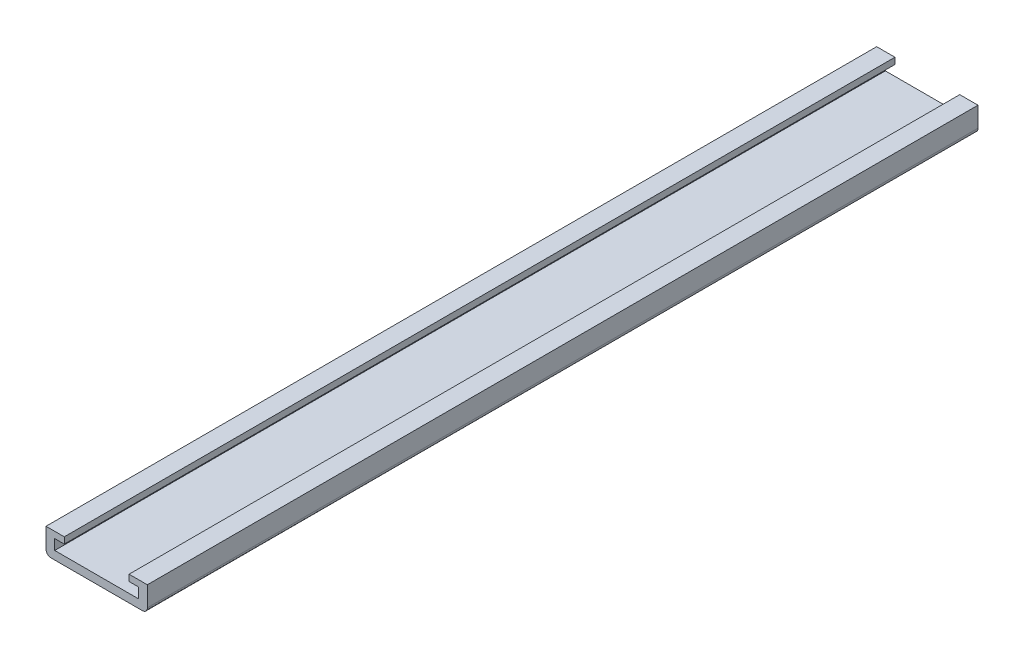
ISO-10303-21;
HEADER;
FILE_DESCRIPTION(('STEP AP214'),'2;1');
FILE_NAME('part.step','',(''),(''),'','','');
FILE_SCHEMA(('AUTOMOTIVE_DESIGN { 1 0 10303 214 1 1 1 1 }'));
ENDSEC;
DATA;
#1=APPLICATION_CONTEXT('core data for automotive mechanical design processes');
#2=APPLICATION_PROTOCOL_DEFINITION('international standard','automotive_design',2000,#1);
#3=PRODUCT_CONTEXT('',#1,'mechanical');
#4=PRODUCT('Part','Part','',(#3));
#5=PRODUCT_RELATED_PRODUCT_CATEGORY('part','',(#4));
#6=PRODUCT_DEFINITION_FORMATION('','',#4);
#7=PRODUCT_DEFINITION_CONTEXT('part definition',#1,'design');
#8=PRODUCT_DEFINITION('design','',#6,#7);
#9=PRODUCT_DEFINITION_SHAPE('','',#8);
#10=(LENGTH_UNIT() NAMED_UNIT(*) SI_UNIT(.MILLI.,.METRE.));
#11=(NAMED_UNIT(*) PLANE_ANGLE_UNIT() SI_UNIT($,.RADIAN.));
#12=(NAMED_UNIT(*) SI_UNIT($,.STERADIAN.) SOLID_ANGLE_UNIT());
#13=UNCERTAINTY_MEASURE_WITH_UNIT(LENGTH_MEASURE(1.E-05),#10,'distance_accuracy_value','');
#14=(GEOMETRIC_REPRESENTATION_CONTEXT(3) GLOBAL_UNCERTAINTY_ASSIGNED_CONTEXT((#13)) GLOBAL_UNIT_ASSIGNED_CONTEXT((#10,
#11,#12)) REPRESENTATION_CONTEXT('',''));
#15=CARTESIAN_POINT('',(0.,0.,0.));
#16=DIRECTION('',(0.,0.,1.));
#17=DIRECTION('',(1.,0.,0.));
#18=AXIS2_PLACEMENT_3D('',#15,#16,#17);
#19=CARTESIAN_POINT('',(27.5,2.9999999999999,500.));
#20=DIRECTION('',(0.,0.,-1.));
#21=DIRECTION('',(-1.,0.,0.));
#22=AXIS2_PLACEMENT_3D('',#19,#20,#21);
#23=CYLINDRICAL_SURFACE('',#22,3.);
#24=CARTESIAN_POINT('',(27.5,2.9999999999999,0.));
#25=DIRECTION('',(0.,0.,1.));
#26=DIRECTION('',(1.,0.,0.));
#27=AXIS2_PLACEMENT_3D('',#24,#25,#26);
#28=CIRCLE('',#27,3.);
#29=CARTESIAN_POINT('',(27.5,0.,0.));
#30=VERTEX_POINT('',#29);
#31=CARTESIAN_POINT('',(30.5,2.9999999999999,0.));
#32=VERTEX_POINT('',#31);
#33=EDGE_CURVE('E158',#30,#32,#28,.T.);
#34=ORIENTED_EDGE('',*,*,#33,.T.);
#35=DIRECTION('',(0.,0.,-1.));
#36=VECTOR('',#35,1.);
#37=CARTESIAN_POINT('',(30.5,2.9999999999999,500.));
#38=LINE('',#37,#36);
#39=CARTESIAN_POINT('',(30.5,2.9999999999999,500.));
#40=VERTEX_POINT('',#39);
#41=EDGE_CURVE('E9',#40,#32,#38,.T.);
#42=ORIENTED_EDGE('',*,*,#41,.F.);
#43=CARTESIAN_POINT('',(27.5,2.9999999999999,500.));
#44=DIRECTION('',(0.,0.,1.));
#45=DIRECTION('',(1.,0.,0.));
#46=AXIS2_PLACEMENT_3D('',#43,#44,#45);
#47=CIRCLE('',#46,3.);
#48=CARTESIAN_POINT('',(27.5,0.,500.));
#49=VERTEX_POINT('',#48);
#50=EDGE_CURVE('E181',#49,#40,#47,.T.);
#51=ORIENTED_EDGE('',*,*,#50,.F.);
#52=DIRECTION('',(0.,0.,-1.));
#53=VECTOR('',#52,1.);
#54=CARTESIAN_POINT('',(27.5,0.,500.));
#55=LINE('',#54,#53);
#56=EDGE_CURVE('E200',#49,#30,#55,.T.);
#57=ORIENTED_EDGE('',*,*,#56,.T.);
#58=EDGE_LOOP('',(#34,#42,#51,#57));
#59=FACE_BOUND('',#58,.T.);
#60=ADVANCED_FACE('F14',(#59),#23,.T.);
#61=CARTESIAN_POINT('',(30.5,2.9999999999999,500.));
#62=DIRECTION('',(-1.,0.,0.));
#63=DIRECTION('',(0.,-1.,0.));
#64=AXIS2_PLACEMENT_3D('',#61,#62,#63);
#65=PLANE('',#64);
#66=DIRECTION('',(0.,1.,0.));
#67=VECTOR('',#66,1.);
#68=CARTESIAN_POINT('',(30.5,2.9999999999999,0.));
#69=LINE('',#68,#67);
#70=CARTESIAN_POINT('',(30.5,15.,0.));
#71=VERTEX_POINT('',#70);
#72=EDGE_CURVE('E162',#32,#71,#69,.T.);
#73=ORIENTED_EDGE('',*,*,#72,.T.);
#74=DIRECTION('',(0.,0.,-1.));
#75=VECTOR('',#74,1.);
#76=CARTESIAN_POINT('',(30.5,15.,500.));
#77=LINE('',#76,#75);
#78=CARTESIAN_POINT('',(30.5,15.,500.));
#79=VERTEX_POINT('',#78);
#80=EDGE_CURVE('E21',#79,#71,#77,.T.);
#81=ORIENTED_EDGE('',*,*,#80,.F.);
#82=DIRECTION('',(0.,1.,0.));
#83=VECTOR('',#82,1.);
#84=CARTESIAN_POINT('',(30.5,2.9999999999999,500.));
#85=LINE('',#84,#83);
#86=EDGE_CURVE('E184',#40,#79,#85,.T.);
#87=ORIENTED_EDGE('',*,*,#86,.F.);
#88=ORIENTED_EDGE('',*,*,#41,.T.);
#89=EDGE_LOOP('',(#73,#81,#87,#88));
#90=FACE_BOUND('',#89,.T.);
#91=ADVANCED_FACE('F248',(#90),#65,.F.);
#92=CARTESIAN_POINT('',(30.5,15.,500.));
#93=DIRECTION('',(0.,-1.,0.));
#94=DIRECTION('',(1.,0.,0.));
#95=AXIS2_PLACEMENT_3D('',#92,#93,#94);
#96=PLANE('',#95);
#97=DIRECTION('',(-1.,0.,0.));
#98=VECTOR('',#97,1.);
#99=CARTESIAN_POINT('',(30.5,15.,0.));
#100=LINE('',#99,#98);
#101=CARTESIAN_POINT('',(19.5,15.,0.));
#102=VERTEX_POINT('',#101);
#103=EDGE_CURVE('E164',#71,#102,#100,.T.);
#104=ORIENTED_EDGE('',*,*,#103,.T.);
#105=DIRECTION('',(0.,0.,-1.));
#106=VECTOR('',#105,1.);
#107=CARTESIAN_POINT('',(19.5,15.,500.));
#108=LINE('',#107,#106);
#109=CARTESIAN_POINT('',(19.5,15.,500.));
#110=VERTEX_POINT('',#109);
#111=EDGE_CURVE('E215',#110,#102,#108,.T.);
#112=ORIENTED_EDGE('',*,*,#111,.F.);
#113=DIRECTION('',(-1.,0.,0.));
#114=VECTOR('',#113,1.);
#115=CARTESIAN_POINT('',(30.5,15.,500.));
#116=LINE('',#115,#114);
#117=EDGE_CURVE('E186',#79,#110,#116,.T.);
#118=ORIENTED_EDGE('',*,*,#117,.F.);
#119=ORIENTED_EDGE('',*,*,#80,.T.);
#120=EDGE_LOOP('',(#104,#112,#118,#119));
#121=FACE_BOUND('',#120,.T.);
#122=ADVANCED_FACE('F222',(#121),#96,.F.);
#123=CARTESIAN_POINT('',(19.5,12.2,500.));
#124=DIRECTION('',(1.,0.,0.));
#125=DIRECTION('',(0.,1.,0.));
#126=AXIS2_PLACEMENT_3D('',#123,#124,#125);
#127=PLANE('',#126);
#128=DIRECTION('',(0.,-1.,0.));
#129=VECTOR('',#128,1.);
#130=CARTESIAN_POINT('',(19.5,12.2,0.));
#131=LINE('',#130,#129);
#132=CARTESIAN_POINT('',(19.5,11.2,0.));
#133=VERTEX_POINT('',#132);
#134=EDGE_CURVE('E166',#102,#133,#131,.T.);
#135=ORIENTED_EDGE('',*,*,#134,.T.);
#136=DIRECTION('',(0.,0.,-1.));
#137=VECTOR('',#136,1.);
#138=CARTESIAN_POINT('',(19.5,11.2,505.836308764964));
#139=LINE('',#138,#137);
#140=CARTESIAN_POINT('',(19.5,11.2,500.));
#141=VERTEX_POINT('',#140);
#142=EDGE_CURVE('E155',#141,#133,#139,.T.);
#143=ORIENTED_EDGE('',*,*,#142,.F.);
#144=DIRECTION('',(0.,-1.,0.));
#145=VECTOR('',#144,1.);
#146=CARTESIAN_POINT('',(19.5,12.2,500.));
#147=LINE('',#146,#145);
#148=EDGE_CURVE('E123',#110,#141,#147,.T.);
#149=ORIENTED_EDGE('',*,*,#148,.F.);
#150=ORIENTED_EDGE('',*,*,#111,.T.);
#151=EDGE_LOOP('',(#135,#143,#149,#150));
#152=FACE_BOUND('',#151,.T.);
#153=ADVANCED_FACE('F232',(#152),#127,.F.);
#154=CARTESIAN_POINT('',(25.25,6.2,500.));
#155=DIRECTION('',(1.,0.,0.));
#156=DIRECTION('',(0.,1.,0.));
#157=AXIS2_PLACEMENT_3D('',#154,#155,#156);
#158=PLANE('',#157);
#159=DIRECTION('',(0.,-1.,0.));
#160=VECTOR('',#159,1.);
#161=CARTESIAN_POINT('',(25.25,6.2,500.));
#162=LINE('',#161,#160);
#163=CARTESIAN_POINT('',(25.25,11.2,500.));
#164=VERTEX_POINT('',#163);
#165=CARTESIAN_POINT('',(25.25,5.,500.));
#166=VERTEX_POINT('',#165);
#167=EDGE_CURVE('E115',#164,#166,#162,.T.);
#168=ORIENTED_EDGE('',*,*,#167,.F.);
#169=DIRECTION('',(0.,0.,-1.));
#170=VECTOR('',#169,1.);
#171=CARTESIAN_POINT('',(25.25,11.2,505.836308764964));
#172=LINE('',#171,#170);
#173=CARTESIAN_POINT('',(25.25,11.2,0.));
#174=VERTEX_POINT('',#173);
#175=EDGE_CURVE('E153',#164,#174,#172,.T.);
#176=ORIENTED_EDGE('',*,*,#175,.T.);
#177=DIRECTION('',(0.,-1.,0.));
#178=VECTOR('',#177,1.);
#179=CARTESIAN_POINT('',(25.25,6.2,0.));
#180=LINE('',#179,#178);
#181=CARTESIAN_POINT('',(25.25,5.,0.));
#182=VERTEX_POINT('',#181);
#183=EDGE_CURVE('E28',#174,#182,#180,.T.);
#184=ORIENTED_EDGE('',*,*,#183,.T.);
#185=DIRECTION('',(0.,0.,-1.));
#186=VECTOR('',#185,1.);
#187=CARTESIAN_POINT('',(25.25,5.,500.));
#188=LINE('',#187,#186);
#189=EDGE_CURVE('E125',#166,#182,#188,.T.);
#190=ORIENTED_EDGE('',*,*,#189,.F.);
#191=EDGE_LOOP('',(#168,#176,#184,#190));
#192=FACE_BOUND('',#191,.T.);
#193=ADVANCED_FACE('F126',(#192),#158,.F.);
#194=CARTESIAN_POINT('',(-25.25,6.20000000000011,500.));
#195=DIRECTION('',(-1.,0.,0.));
#196=DIRECTION('',(0.,-1.,0.));
#197=AXIS2_PLACEMENT_3D('',#194,#195,#196);
#198=PLANE('',#197);
#199=DIRECTION('',(0.,1.,0.));
#200=VECTOR('',#199,1.);
#201=CARTESIAN_POINT('',(-25.25,6.20000000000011,0.));
#202=LINE('',#201,#200);
#203=CARTESIAN_POINT('',(-25.25,5.,0.));
#204=VERTEX_POINT('',#203);
#205=CARTESIAN_POINT('',(-25.25,11.2,0.));
#206=VERTEX_POINT('',#205);
#207=EDGE_CURVE('E169',#204,#206,#202,.T.);
#208=ORIENTED_EDGE('',*,*,#207,.T.);
#209=DIRECTION('',(0.,0.,-1.));
#210=VECTOR('',#209,1.);
#211=CARTESIAN_POINT('',(-25.25,11.2,505.836308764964));
#212=LINE('',#211,#210);
#213=CARTESIAN_POINT('',(-25.25,11.2,500.));
#214=VERTEX_POINT('',#213);
#215=EDGE_CURVE('E36',#214,#206,#212,.T.);
#216=ORIENTED_EDGE('',*,*,#215,.F.);
#217=DIRECTION('',(0.,1.,0.));
#218=VECTOR('',#217,1.);
#219=CARTESIAN_POINT('',(-25.25,6.20000000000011,500.));
#220=LINE('',#219,#218);
#221=CARTESIAN_POINT('',(-25.25,5.,500.));
#222=VERTEX_POINT('',#221);
#223=EDGE_CURVE('E122',#222,#214,#220,.T.);
#224=ORIENTED_EDGE('',*,*,#223,.F.);
#225=DIRECTION('',(0.,0.,-1.));
#226=VECTOR('',#225,1.);
#227=CARTESIAN_POINT('',(-25.25,5.,500.));
#228=LINE('',#227,#226);
#229=EDGE_CURVE('E130',#222,#204,#228,.T.);
#230=ORIENTED_EDGE('',*,*,#229,.T.);
#231=EDGE_LOOP('',(#208,#216,#224,#230));
#232=FACE_BOUND('',#231,.T.);
#233=ADVANCED_FACE('F281',(#232),#198,.F.);
#234=CARTESIAN_POINT('',(-19.5,12.2,500.));
#235=DIRECTION('',(-1.,0.,0.));
#236=DIRECTION('',(0.,-1.,0.));
#237=AXIS2_PLACEMENT_3D('',#234,#235,#236);
#238=PLANE('',#237);
#239=DIRECTION('',(0.,1.,0.));
#240=VECTOR('',#239,1.);
#241=CARTESIAN_POINT('',(-19.5,12.2,0.));
#242=LINE('',#241,#240);
#243=CARTESIAN_POINT('',(-19.5,11.2,0.));
#244=VERTEX_POINT('',#243);
#245=CARTESIAN_POINT('',(-19.5,15.,0.));
#246=VERTEX_POINT('',#245);
#247=EDGE_CURVE('E171',#244,#246,#242,.T.);
#248=ORIENTED_EDGE('',*,*,#247,.T.);
#249=DIRECTION('',(0.,0.,-1.));
#250=VECTOR('',#249,1.);
#251=CARTESIAN_POINT('',(-19.5,15.,500.));
#252=LINE('',#251,#250);
#253=CARTESIAN_POINT('',(-19.5,15.,500.));
#254=VERTEX_POINT('',#253);
#255=EDGE_CURVE('E212',#254,#246,#252,.T.);
#256=ORIENTED_EDGE('',*,*,#255,.F.);
#257=DIRECTION('',(0.,1.,0.));
#258=VECTOR('',#257,1.);
#259=CARTESIAN_POINT('',(-19.5,12.2,500.));
#260=LINE('',#259,#258);
#261=CARTESIAN_POINT('',(-19.5,11.2,500.));
#262=VERTEX_POINT('',#261);
#263=EDGE_CURVE('E190',#262,#254,#260,.T.);
#264=ORIENTED_EDGE('',*,*,#263,.F.);
#265=DIRECTION('',(0.,0.,-1.));
#266=VECTOR('',#265,1.);
#267=CARTESIAN_POINT('',(-19.5,11.2,505.836308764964));
#268=LINE('',#267,#266);
#269=EDGE_CURVE('E147',#262,#244,#268,.T.);
#270=ORIENTED_EDGE('',*,*,#269,.T.);
#271=EDGE_LOOP('',(#248,#256,#264,#270));
#272=FACE_BOUND('',#271,.T.);
#273=ADVANCED_FACE('F277',(#272),#238,.F.);
#274=CARTESIAN_POINT('',(-19.5,15.,500.));
#275=DIRECTION('',(0.,-1.,0.));
#276=DIRECTION('',(1.,0.,0.));
#277=AXIS2_PLACEMENT_3D('',#274,#275,#276);
#278=PLANE('',#277);
#279=DIRECTION('',(-1.,0.,0.));
#280=VECTOR('',#279,1.);
#281=CARTESIAN_POINT('',(-19.5,15.,0.));
#282=LINE('',#281,#280);
#283=CARTESIAN_POINT('',(-30.5,15.,0.));
#284=VERTEX_POINT('',#283);
#285=EDGE_CURVE('E173',#246,#284,#282,.T.);
#286=ORIENTED_EDGE('',*,*,#285,.T.);
#287=DIRECTION('',(0.,0.,-1.));
#288=VECTOR('',#287,1.);
#289=CARTESIAN_POINT('',(-30.5,15.,500.));
#290=LINE('',#289,#288);
#291=CARTESIAN_POINT('',(-30.5,15.,500.));
#292=VERTEX_POINT('',#291);
#293=EDGE_CURVE('E209',#292,#284,#290,.T.);
#294=ORIENTED_EDGE('',*,*,#293,.F.);
#295=DIRECTION('',(-1.,0.,0.));
#296=VECTOR('',#295,1.);
#297=CARTESIAN_POINT('',(-19.5,15.,500.));
#298=LINE('',#297,#296);
#299=EDGE_CURVE('E192',#254,#292,#298,.T.);
#300=ORIENTED_EDGE('',*,*,#299,.F.);
#301=ORIENTED_EDGE('',*,*,#255,.T.);
#302=EDGE_LOOP('',(#286,#294,#300,#301));
#303=FACE_BOUND('',#302,.T.);
#304=ADVANCED_FACE('F273',(#303),#278,.F.);
#305=CARTESIAN_POINT('',(-30.5,3.00000000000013,500.));
#306=DIRECTION('',(1.,0.,0.));
#307=DIRECTION('',(0.,1.,0.));
#308=AXIS2_PLACEMENT_3D('',#305,#306,#307);
#309=PLANE('',#308);
#310=DIRECTION('',(0.,-1.,0.));
#311=VECTOR('',#310,1.);
#312=CARTESIAN_POINT('',(-30.5,3.00000000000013,0.));
#313=LINE('',#312,#311);
#314=CARTESIAN_POINT('',(-30.5,3.00000000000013,0.));
#315=VERTEX_POINT('',#314);
#316=EDGE_CURVE('E175',#284,#315,#313,.T.);
#317=ORIENTED_EDGE('',*,*,#316,.T.);
#318=DIRECTION('',(0.,0.,-1.));
#319=VECTOR('',#318,1.);
#320=CARTESIAN_POINT('',(-30.5,3.00000000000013,500.));
#321=LINE('',#320,#319);
#322=CARTESIAN_POINT('',(-30.5,3.00000000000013,500.));
#323=VERTEX_POINT('',#322);
#324=EDGE_CURVE('E206',#323,#315,#321,.T.);
#325=ORIENTED_EDGE('',*,*,#324,.F.);
#326=DIRECTION('',(0.,-1.,0.));
#327=VECTOR('',#326,1.);
#328=CARTESIAN_POINT('',(-30.5,3.00000000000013,500.));
#329=LINE('',#328,#327);
#330=EDGE_CURVE('E194',#292,#323,#329,.T.);
#331=ORIENTED_EDGE('',*,*,#330,.F.);
#332=ORIENTED_EDGE('',*,*,#293,.T.);
#333=EDGE_LOOP('',(#317,#325,#331,#332));
#334=FACE_BOUND('',#333,.T.);
#335=ADVANCED_FACE('F269',(#334),#309,.F.);
#336=CARTESIAN_POINT('',(-27.5,3.0000000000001,500.));
#337=DIRECTION('',(0.,0.,-1.));
#338=DIRECTION('',(-1.,0.,0.));
#339=AXIS2_PLACEMENT_3D('',#336,#337,#338);
#340=CYLINDRICAL_SURFACE('',#339,3.);
#341=CARTESIAN_POINT('',(-27.5,3.0000000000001,0.));
#342=DIRECTION('',(0.,0.,1.));
#343=DIRECTION('',(1.,0.,0.));
#344=AXIS2_PLACEMENT_3D('',#341,#342,#343);
#345=CIRCLE('',#344,3.);
#346=CARTESIAN_POINT('',(-27.5,0.,0.));
#347=VERTEX_POINT('',#346);
#348=EDGE_CURVE('E177',#315,#347,#345,.T.);
#349=ORIENTED_EDGE('',*,*,#348,.T.);
#350=DIRECTION('',(0.,0.,-1.));
#351=VECTOR('',#350,1.);
#352=CARTESIAN_POINT('',(-27.5,0.,500.));
#353=LINE('',#352,#351);
#354=CARTESIAN_POINT('',(-27.5,0.,500.));
#355=VERTEX_POINT('',#354);
#356=EDGE_CURVE('E203',#355,#347,#353,.T.);
#357=ORIENTED_EDGE('',*,*,#356,.F.);
#358=CARTESIAN_POINT('',(-27.5,3.0000000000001,500.));
#359=DIRECTION('',(0.,0.,1.));
#360=DIRECTION('',(1.,0.,0.));
#361=AXIS2_PLACEMENT_3D('',#358,#359,#360);
#362=CIRCLE('',#361,3.);
#363=EDGE_CURVE('E196',#323,#355,#362,.T.);
#364=ORIENTED_EDGE('',*,*,#363,.F.);
#365=ORIENTED_EDGE('',*,*,#324,.T.);
#366=EDGE_LOOP('',(#349,#357,#364,#365));
#367=FACE_BOUND('',#366,.T.);
#368=ADVANCED_FACE('F265',(#367),#340,.T.);
#369=CARTESIAN_POINT('',(27.5,0.,500.));
#370=DIRECTION('',(0.,1.,0.));
#371=DIRECTION('',(-1.,0.,0.));
#372=AXIS2_PLACEMENT_3D('',#369,#370,#371);
#373=PLANE('',#372);
#374=DIRECTION('',(1.,0.,0.));
#375=VECTOR('',#374,1.);
#376=CARTESIAN_POINT('',(27.5,0.,0.));
#377=LINE('',#376,#375);
#378=EDGE_CURVE('E179',#347,#30,#377,.T.);
#379=ORIENTED_EDGE('',*,*,#378,.T.);
#380=ORIENTED_EDGE('',*,*,#56,.F.);
#381=DIRECTION('',(1.,0.,0.));
#382=VECTOR('',#381,1.);
#383=CARTESIAN_POINT('',(27.5,0.,500.));
#384=LINE('',#383,#382);
#385=EDGE_CURVE('E198',#355,#49,#384,.T.);
#386=ORIENTED_EDGE('',*,*,#385,.F.);
#387=ORIENTED_EDGE('',*,*,#356,.T.);
#388=EDGE_LOOP('',(#379,#380,#386,#387));
#389=FACE_BOUND('',#388,.T.);
#390=ADVANCED_FACE('F260',(#389),#373,.F.);
#391=CARTESIAN_POINT('',(27.5,2.9999999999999,500.));
#392=DIRECTION('',(0.,0.,1.));
#393=DIRECTION('',(1.,0.,0.));
#394=AXIS2_PLACEMENT_3D('',#391,#392,#393);
#395=PLANE('',#394);
#396=ORIENTED_EDGE('',*,*,#167,.T.);
#397=DIRECTION('',(-1.,0.,0.));
#398=VECTOR('',#397,1.);
#399=CARTESIAN_POINT('',(25.25,5.,500.));
#400=LINE('',#399,#398);
#401=EDGE_CURVE('E118',#166,#222,#400,.T.);
#402=ORIENTED_EDGE('',*,*,#401,.T.);
#403=ORIENTED_EDGE('',*,*,#223,.T.);
#404=DIRECTION('',(-1.,0.,0.));
#405=VECTOR('',#404,1.);
#406=CARTESIAN_POINT('',(-19.5,11.2,500.));
#407=LINE('',#406,#405);
#408=EDGE_CURVE('E143',#262,#214,#407,.T.);
#409=ORIENTED_EDGE('',*,*,#408,.F.);
#410=ORIENTED_EDGE('',*,*,#263,.T.);
#411=ORIENTED_EDGE('',*,*,#299,.T.);
#412=ORIENTED_EDGE('',*,*,#330,.T.);
#413=ORIENTED_EDGE('',*,*,#363,.T.);
#414=ORIENTED_EDGE('',*,*,#385,.T.);
#415=ORIENTED_EDGE('',*,*,#50,.T.);
#416=ORIENTED_EDGE('',*,*,#86,.T.);
#417=ORIENTED_EDGE('',*,*,#117,.T.);
#418=ORIENTED_EDGE('',*,*,#148,.T.);
#419=DIRECTION('',(-1.,0.,0.));
#420=VECTOR('',#419,1.);
#421=CARTESIAN_POINT('',(19.5,11.2,500.));
#422=LINE('',#421,#420);
#423=EDGE_CURVE('E120',#164,#141,#422,.T.);
#424=ORIENTED_EDGE('',*,*,#423,.F.);
#425=EDGE_LOOP('',(#396,#402,#403,#409,#410,#411,#412,#413,#414,#415,#416,#417,#418,#424));
#426=FACE_BOUND('',#425,.T.);
#427=ADVANCED_FACE('F116',(#426),#395,.T.);
#428=CARTESIAN_POINT('',(27.5,2.9999999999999,0.));
#429=DIRECTION('',(0.,0.,1.));
#430=DIRECTION('',(1.,0.,0.));
#431=AXIS2_PLACEMENT_3D('',#428,#429,#430);
#432=PLANE('',#431);
#433=DIRECTION('',(-1.,0.,0.));
#434=VECTOR('',#433,1.);
#435=CARTESIAN_POINT('',(25.25,5.,0.));
#436=LINE('',#435,#434);
#437=EDGE_CURVE('E135',#182,#204,#436,.T.);
#438=ORIENTED_EDGE('',*,*,#437,.F.);
#439=ORIENTED_EDGE('',*,*,#183,.F.);
#440=DIRECTION('',(-1.,0.,0.));
#441=VECTOR('',#440,1.);
#442=CARTESIAN_POINT('',(19.5,11.2,0.));
#443=LINE('',#442,#441);
#444=EDGE_CURVE('E150',#174,#133,#443,.T.);
#445=ORIENTED_EDGE('',*,*,#444,.T.);
#446=ORIENTED_EDGE('',*,*,#134,.F.);
#447=ORIENTED_EDGE('',*,*,#103,.F.);
#448=ORIENTED_EDGE('',*,*,#72,.F.);
#449=ORIENTED_EDGE('',*,*,#33,.F.);
#450=ORIENTED_EDGE('',*,*,#378,.F.);
#451=ORIENTED_EDGE('',*,*,#348,.F.);
#452=ORIENTED_EDGE('',*,*,#316,.F.);
#453=ORIENTED_EDGE('',*,*,#285,.F.);
#454=ORIENTED_EDGE('',*,*,#247,.F.);
#455=DIRECTION('',(-1.,0.,0.));
#456=VECTOR('',#455,1.);
#457=CARTESIAN_POINT('',(-19.5,11.2,0.));
#458=LINE('',#457,#456);
#459=EDGE_CURVE('E139',#244,#206,#458,.T.);
#460=ORIENTED_EDGE('',*,*,#459,.T.);
#461=ORIENTED_EDGE('',*,*,#207,.F.);
#462=EDGE_LOOP('',(#438,#439,#445,#446,#447,#448,#449,#450,#451,#452,#453,#454,#460,#461));
#463=FACE_BOUND('',#462,.T.);
#464=ADVANCED_FACE('F227',(#463),#432,.F.);
#465=CARTESIAN_POINT('',(19.5,11.2,505.836308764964));
#466=DIRECTION('',(0.,-1.,0.));
#467=DIRECTION('',(0.,0.,-1.));
#468=AXIS2_PLACEMENT_3D('',#465,#466,#467);
#469=PLANE('',#468);
#470=ORIENTED_EDGE('',*,*,#175,.F.);
#471=ORIENTED_EDGE('',*,*,#423,.T.);
#472=ORIENTED_EDGE('',*,*,#142,.T.);
#473=ORIENTED_EDGE('',*,*,#444,.F.);
#474=EDGE_LOOP('',(#470,#471,#472,#473));
#475=FACE_BOUND('',#474,.T.);
#476=ADVANCED_FACE('F235',(#475),#469,.T.);
#477=CARTESIAN_POINT('',(-19.5,11.2,505.836308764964));
#478=DIRECTION('',(0.,-1.,0.));
#479=DIRECTION('',(0.,0.,-1.));
#480=AXIS2_PLACEMENT_3D('',#477,#478,#479);
#481=PLANE('',#480);
#482=ORIENTED_EDGE('',*,*,#269,.F.);
#483=ORIENTED_EDGE('',*,*,#408,.T.);
#484=ORIENTED_EDGE('',*,*,#215,.T.);
#485=ORIENTED_EDGE('',*,*,#459,.F.);
#486=EDGE_LOOP('',(#482,#483,#484,#485));
#487=FACE_BOUND('',#486,.T.);
#488=ADVANCED_FACE('F237',(#487),#481,.T.);
#489=CARTESIAN_POINT('',(25.25,5.,500.));
#490=DIRECTION('',(0.,-1.,0.));
#491=DIRECTION('',(0.,0.,-1.));
#492=AXIS2_PLACEMENT_3D('',#489,#490,#491);
#493=PLANE('',#492);
#494=ORIENTED_EDGE('',*,*,#437,.T.);
#495=ORIENTED_EDGE('',*,*,#229,.F.);
#496=ORIENTED_EDGE('',*,*,#401,.F.);
#497=ORIENTED_EDGE('',*,*,#189,.T.);
#498=EDGE_LOOP('',(#494,#495,#496,#497));
#499=FACE_BOUND('',#498,.T.);
#500=ADVANCED_FACE('F133',(#499),#493,.F.);
#501=CLOSED_SHELL('',(#60,#91,#122,#153,#193,#233,#273,#304,#335,#368,#390,#427,#464,#476,#488,#500));
#502=MANIFOLD_SOLID_BREP('B1',#501);
#503=ADVANCED_BREP_SHAPE_REPRESENTATION('',(#18,#502),#14);
#504=SHAPE_DEFINITION_REPRESENTATION(#9,#503);
ENDSEC;
END-ISO-10303-21;
